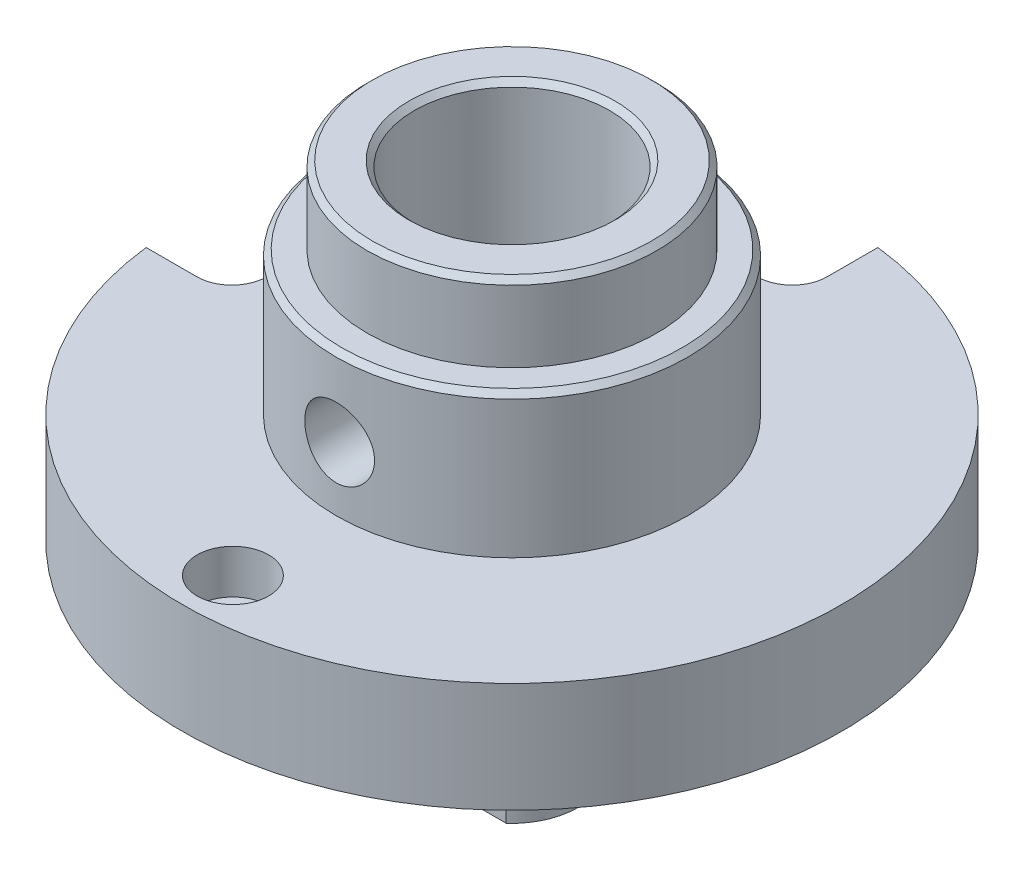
from build123d import *

# Parameters (mm, degrees)
SKETCH2_R             = 1.5875
CUT_EXTRUDE1_DEPTH    = 26.980762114
SKETCH8_R             = 1.5875
CUT_EXTRUDE7_DEPTH    = 26.980762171
SKETCH3_R             = 0.5
CUT_EXTRUDE2_DEPTH    = 26.416530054
SKETCH4_R             = 1.6256
CUT_EXTRUDE3_DEPTH    = 2
CUT_EXTRUDE4_DEPTH    = 7
CUT_EXTRUDE5_REACH    = 27.417
CHAMFER3_SIZE         = 0.25
FILLET2_R             = 1.5875
F_4_40_TAPPED_HOLE1_D = 2.2606
FILLET3_R             = 1.5875


with BuildPart() as part:
    # Sketch1 → Revolve1 (revolve)
    with BuildSketch(Plane.XY, mode=Mode.PRIVATE) as revolve1_sk:
        with BuildLine():
            Line((6.6, 15), (6.6, 11.5))
            Line((6.6, 11.5), (8, 11.5))
            Line((8, 11.5), (8, 5))
            Line((8, 5), (15, 5))
            Line((15, 5), (15, 0))
            Line((15, 0), (3, 0))
            Line((3, 0), (3, -9))
            Line((3, -9), (0, -9))
            Line((0, -9), (0, 2.5))
            Line((0, 2.5), (3.945, 2.5))
            ThreePointArc((3.945, 2.5), (4.298553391, 2.646446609), (4.445, 3))
            Line((4.445, 3), (4.445, 15))
            Line((4.445, 15), (6.6, 15))
        make_face()
    revolve(revolve1_sk.sketch.rotate(Axis((0, -70.5, 0), (0, 1, 0)), 90), axis=Axis((0, -70.5, 0), (0, 1, 0)))

    # Sketch2 → Cut-Extrude1 (cut, through all)
    with BuildSketch(Plane.XY):
        with Locations(Location((0, 7.89, 0), (0, 0, 270))):
            Circle(SKETCH2_R)
    extrude(amount=-CUT_EXTRUDE1_DEPTH, mode=Mode.SUBTRACT)

    # Sketch8 → Cut-Extrude7 (cut, through all)
    with BuildSketch(Plane.XY):
        with Locations(Location((0, 7.89, 0), (0, 0, 270))):
            Circle(SKETCH8_R)
    extrude(amount=CUT_EXTRUDE7_DEPTH, mode=Mode.SUBTRACT)

    # Sketch3 → Cut-Extrude2 (cut, through all)
    with BuildSketch(Plane(origin=(0, 5, 0), x_dir=(1, 0, 0), z_dir=(0, 1, 0))):
        with Locations(Location((0, -12.7, 0), (0, 0, 270))):
            Circle(SKETCH3_R)
    extrude(amount=-CUT_EXTRUDE2_DEPTH, mode=Mode.SUBTRACT)

    # Sketch4 → Cut-Extrude3 (cut)
    with BuildSketch(Plane(origin=(0, 5, 0), x_dir=(1, 0, 0), z_dir=(0, 1, 0))):
        with Locations(Location((0, -12.7, 0), (0, 0, 270))):
            Circle(SKETCH4_R)
    extrude(amount=-CUT_EXTRUDE3_DEPTH, mode=Mode.SUBTRACT)

    # Sketch5 → Cut-Extrude4 (cut)
    with BuildSketch(Plane.XZ.offset(9)):
        with BuildLine():
            Line((-1.984313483, 2.25), (1.984313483, 2.25))
            ThreePointArc((1.984313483, 2.25), (0, 3), (-1.984313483, 2.25))
        make_face()
    extrude(amount=-CUT_EXTRUDE4_DEPTH, mode=Mode.SUBTRACT)

    # Sketch6 → Cut-Extrude5 (cut, up to next)
    with BuildSketch(Plane(origin=(0, 5, 0), x_dir=(1, 0, 0), z_dir=(0, 1, 0)), mode=Mode.PRIVATE) as cut_extrude5_sk1:
        with BuildLine():
            Line((1.75, 14.897566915), (1.75, 11))
            Line((1.75, 11), (0, 11))
            ThreePointArc((0, 11), (-7.778174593, 7.778174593), (-11, 0))
            Line((-11, 0), (-11, -1.75))
            Line((-11, -1.75), (-14.897566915, -1.75))
            ThreePointArc((-14.897566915, -1.75), (-10.606601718, 10.606601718), (1.75, 14.897566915))
        make_face()
    cut_extrude5_tool1 = extrude(cut_extrude5_sk1.sketch, amount=-CUT_EXTRUDE5_REACH, mode=Mode.PRIVATE) & part.part
    add(cut_extrude5_tool1.solids().sort_by_distance((-8.009386, 5, -8.009386))[0], mode=Mode.SUBTRACT)

    # Chamfer3
    chamfer3_edges = [part.edges().sort_by_distance(p)[0] for p in [
        (0, 11.5, 8),
        (0, 15, 6.6),
        (0, 15, 4.445),
    ]]
    chamfer(chamfer3_edges, length=CHAMFER3_SIZE)

    # Fillet2
    fillet2_edges = [part.edges().sort_by_distance(p)[0] for p in [
        (0, 0, 3),
    ]]
    fillet(fillet2_edges, radius=FILLET2_R)

    # 4-40 Tapped Hole1 (through all)
    with Locations(Plane(origin=(0, 5, 0), x_dir=(-1, 0, 0), z_dir=(0, 1, 0))):
        with Locations((0, 12.7)):
            Hole(F_4_40_TAPPED_HOLE1_D / 2)

    # Fillet3
    fillet3_edges = [part.edges().sort_by_distance(p)[0] for p in [
        (1.75, 2.5, -11),
        (-11, 2.5, 1.75),
    ]]
    fillet(fillet3_edges, radius=FILLET3_R)


solid = part.part
